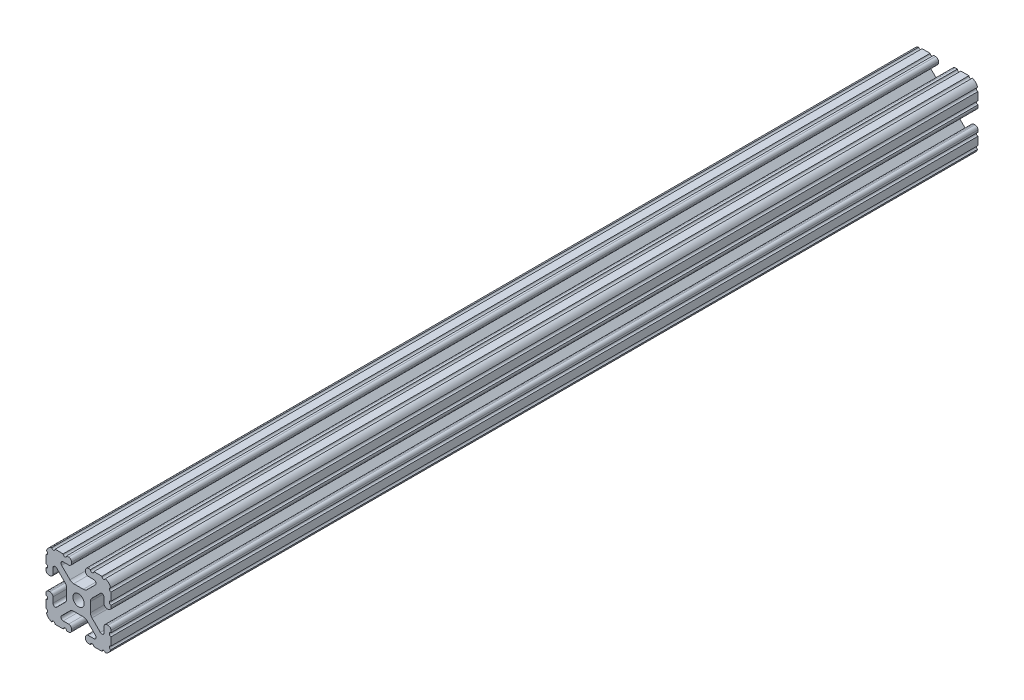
from build123d import *

# Parameters (mm, degrees)
BOSS_EXTRUDE1_DEPTH     = 457.2
CUT_EXTRUDE1_DEPTH      = 458.993062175
CUT_EXTRUDE1_DEPTH_BACK = 458.993062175
SKETCH5_R               = 1.016
SKETCH6_W               = 39.134581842
SKETCH6_H               = 38.977379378
CUT_EXTRUDE2_DEPTH      = 406.4


with BuildPart() as part:
    # Sketch4 → Boss-Extrude1 (new, symmetric)
    with BuildSketch(Plane.XY):
        with BuildLine():
            Line((5.7912, -19.05), (14.3002, -19.05))
            ThreePointArc((14.3002, -19.05), (17.658815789, -17.658815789), (19.05, -14.3002))
            Line((19.05, -14.3002), (19.05, -5.7912))
            ThreePointArc((19.05, -5.7912), (18.544114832, -4.569885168), (17.3228, -4.064))
            Line((17.3228, -4.064), (16.7132, -4.064))
            ThreePointArc((16.7132, -4.064), (15.491885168, -4.569885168), (14.986, -5.7912))
            Line((14.986, -5.7912), (14.986, -8.996305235))
            ThreePointArc((14.986, -8.996305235), (14.189232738, -10.188751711), (12.782646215, -9.908964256))
            Line((12.782646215, -9.908964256), (7.888897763, -5.015215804))
            ThreePointArc((7.888897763, -5.015215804), (7.219915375, -4.014012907), (6.985, -2.833013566))
            Line((6.985, -2.833013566), (6.985, 0))
            Line((6.985, 0), (3.3274, 0))
            ThreePointArc((3.3274, 0), (2.352827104, -2.352827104), (0, -3.3274))
            Line((0, -3.3274), (0, -6.985))
            Line((0, -6.985), (2.833013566, -6.985))
            ThreePointArc((2.833013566, -6.985), (4.014012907, -7.219915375), (5.015215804, -7.888897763))
            Line((5.015215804, -7.888897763), (9.908964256, -12.782646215))
            ThreePointArc((9.908964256, -12.782646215), (10.188751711, -14.189232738), (8.996305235, -14.986))
            Line((8.996305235, -14.986), (5.7912, -14.986))
            ThreePointArc((5.7912, -14.986), (4.569885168, -15.491885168), (4.064, -16.7132))
            Line((4.064, -16.7132), (4.064, -17.3228))
            ThreePointArc((4.064, -17.3228), (4.569885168, -18.544114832), (5.7912, -19.05))
        make_face()
    extrude(amount=BOSS_EXTRUDE1_DEPTH, both=True)

    # Sketch5 → Cut-Extrude1 (cut, two sides: drawn at the far end of the back side and taken through both)
    with BuildSketch(Plane.XY.offset(-CUT_EXTRUDE1_DEPTH_BACK)):
        with Locations((14.739477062, -19.05)):
            Circle(SKETCH5_R)
        with Locations((7.980305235, -19.05)):
            Circle(SKETCH5_R)
        with Locations((19.05, -14.739477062)):
            Circle(SKETCH5_R)
        with Locations((19.05, -7.980305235)):
            Circle(SKETCH5_R)
    extrude(amount=CUT_EXTRUDE1_DEPTH + CUT_EXTRUDE1_DEPTH_BACK, mode=Mode.SUBTRACT)

    # Mirror1: part across plane


with BuildPart() as part_1:
    add(part.part)
    add(part.part.mirror(Plane(origin=(0, 0, 0), x_dir=(0, 0, 1), z_dir=(1, 0, 0))))

    # Mirror2: part across plane


with BuildPart() as part_2:
    add(part_1.part)
    add(part_1.part.mirror(Plane.ZX))

    # Sketch6 → Cut-Extrude2 (cut)
    with BuildSketch(Plane.XY.offset(457.2)):
        Rectangle(SKETCH6_W, SKETCH6_H)
    extrude(amount=-CUT_EXTRUDE2_DEPTH, mode=Mode.SUBTRACT)


solid = part_2.part
